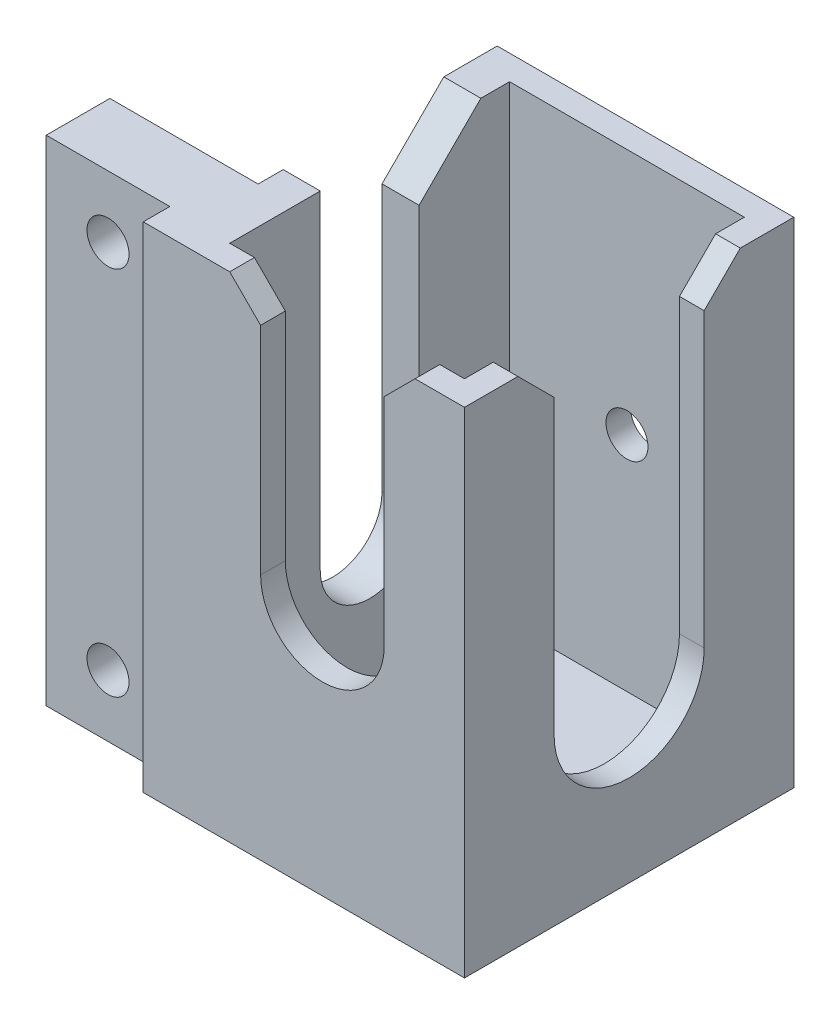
from build123d import *

# Parameters (mm, degrees)
SKETCH1_W                                        = 19
SKETCH1_H                                        = 22.65
BOSS_EXTRUDE1_DEPTH                              = 40
SKETCH2_W                                        = 3.46
SKETCH2_H                                        = 5.5
BOSS_EXTRUDE2_DEPTH                              = 2
CUT_EXTRUDE1_DEPTH                               = 3
CUT_EXTRUDE2_DEPTH                               = 2
CUT_EXTRUDE3_DEPTH                               = 2
CUT_EXTRUDE4_DEPTH                               = 12
CBORE_FOR_M3_PAN_HEAD_MACHINE_SCREW1_D           = 3.4
CBORE_FOR_M3_PAN_HEAD_MACHINE_SCREW1_DEPTH       = 14.978536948
CBORE_FOR_M3_PAN_HEAD_MACHINE_SCREW1_CBORE_D     = 7
CBORE_FOR_M3_PAN_HEAD_MACHINE_SCREW1_CBORE_DEPTH = 2.4
CBORE_FOR_M3_PAN_HEAD_MACHINE_SCREW1_TIP         = 1.021463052
SKETCH11_R                                       = 1.7
CUT_EXTRUDE5_DEPTH                               = 2
CHAMFER2_SIZE                                    = 5
CUT_EXTRUDE6_DEPTH                               = 2
CHAMFER3_SIZE                                    = 2.5


with BuildPart() as part:
    # Sketch1 → Boss-Extrude1 (new body)
    with BuildSketch(Plane(origin=(0, 0, 0), x_dir=(1, 0, 0), z_dir=(0, 1, 0))):
        Polygon((-14.5, -13.325), (11.5, -13.325), (11.5, 13.325), (-12.5, 13.325), (-12.5, -6.025), (-24.5, -6.025), (-24.5, -11.175), (-14.5, -11.175), align=None)
        Rectangle(SKETCH1_W, SKETCH1_H, mode=Mode.SUBTRACT)
    extrude(amount=BOSS_EXTRUDE1_DEPTH)

    # Sketch2 → Boss-Extrude2 (add)
    with BuildSketch(Plane.XZ):
        Polygon((-14.5, 13.325), (-14.5, 11.175), (-24.5, 11.175), (-24.5, 6.025), (-12.5, 6.025), (-12.5, -13.325), (11.5, -13.325), (11.5, 13.325), align=None)
        Rectangle(SKETCH2_W, SKETCH2_H, mode=Mode.SUBTRACT)
    extrude(amount=-BOSS_EXTRUDE2_DEPTH)

    # Sketch3 → Cut-Extrude1 (cut)
    with BuildSketch(Plane.ZY.offset(12.5)):
        with BuildLine():
            Line((4, 46.445950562), (4, 13.43))
            ThreePointArc((4, 13.43), (0, 9.43), (-4, 13.43))
            Line((-4, 13.43), (-4, 46.445950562))
            ThreePointArc((-4, 46.445950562), (0, 50.445950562), (4, 46.445950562))
        make_face()
    extrude(amount=-CUT_EXTRUDE1_DEPTH, mode=Mode.SUBTRACT)

    # Sketch4 → Cut-Extrude2 (cut)
    with BuildSketch(Plane.ZY.offset(-9.5)):
        with BuildLine():
            Line((6.075, 43.362668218), (6.075, 13.43))
            ThreePointArc((6.075, 13.43), (0, 7.355), (-6.075, 13.43))
            Line((-6.075, 13.43), (-6.075, 43.362668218))
            ThreePointArc((-6.075, 43.362668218), (0, 49.437668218), (6.075, 43.362668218))
        make_face()
    extrude(amount=-CUT_EXTRUDE2_DEPTH, mode=Mode.SUBTRACT)

    # Sketch5 → Cut-Extrude3 (cut)
    with BuildSketch(Plane.XY.offset(13.325)):
        with BuildLine():
            Line((5, 47.930635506), (5, 20))
            ThreePointArc((5, 20), (0, 15), (-5, 20))
            Line((-5, 20), (-5, 47.930635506))
            ThreePointArc((-5, 47.930635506), (0, 52.930635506), (5, 47.930635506))
        make_face()
    extrude(amount=-CUT_EXTRUDE3_DEPTH, mode=Mode.SUBTRACT)

    # Sketch7 → Cut-Extrude4 (cut)
    with BuildSketch(Plane.ZY.offset(24.5)):
        Polygon((6.025, 30), (10.175, 25.85), (10.175, 14.15), (6.025, 10), align=None)
    extrude(amount=-CUT_EXTRUDE4_DEPTH, mode=Mode.SUBTRACT)

    # CBORE for M3 Pan Head Machine Screw1
    with Locations(Plane(origin=(0, 0, 6.025), x_dir=(-1, 0, 0), z_dir=(0, 0, -1))):
        with Locations((19.5, 35), (19.5, 5)):
            CounterBoreHole(CBORE_FOR_M3_PAN_HEAD_MACHINE_SCREW1_D / 2, CBORE_FOR_M3_PAN_HEAD_MACHINE_SCREW1_CBORE_D / 2, CBORE_FOR_M3_PAN_HEAD_MACHINE_SCREW1_CBORE_DEPTH, depth=CBORE_FOR_M3_PAN_HEAD_MACHINE_SCREW1_DEPTH)
            with Locations((0, 0, -(CBORE_FOR_M3_PAN_HEAD_MACHINE_SCREW1_DEPTH + CBORE_FOR_M3_PAN_HEAD_MACHINE_SCREW1_TIP / 2))):  # 118° drill point
                Cone(0, CBORE_FOR_M3_PAN_HEAD_MACHINE_SCREW1_D / 2, CBORE_FOR_M3_PAN_HEAD_MACHINE_SCREW1_TIP, mode=Mode.SUBTRACT)

    # Sketch11 → Cut-Extrude5 (cut)
    with BuildSketch(Plane(origin=(0, 0, -13.325), x_dir=(-1, 0, 0), z_dir=(0, 0, -1))):
        with Locations((0, 20)):
            Circle(SKETCH11_R)
    extrude(amount=-CUT_EXTRUDE5_DEPTH, mode=Mode.SUBTRACT)

    # Chamfer2
    chamfer2_edges = [part.edges().sort_by_distance(p)[0] for p in [
        (-11, 40, -4),
    ]]
    chamfer(chamfer2_edges, length=CHAMFER2_SIZE)

    # Sketch12 → Cut-Extrude6 (cut)
    with BuildSketch(Plane(origin=(11.5, 0, 0), x_dir=(0, 0, -1), z_dir=(1, 0, 0))):
        Polygon((4, 35), (9, 40), (4, 40), align=None)
        Polygon((-4, 40), (-4, 35), (-9, 40), align=None)
    extrude(amount=-CUT_EXTRUDE6_DEPTH, mode=Mode.SUBTRACT)

    # Chamfer3
    chamfer3_edges = [part.edges().sort_by_distance(p)[0] for p in [
        (5, 40, 12.325),
        (-5, 40, 12.325),
    ]]
    chamfer(chamfer3_edges, length=CHAMFER3_SIZE)


solid = part.part
